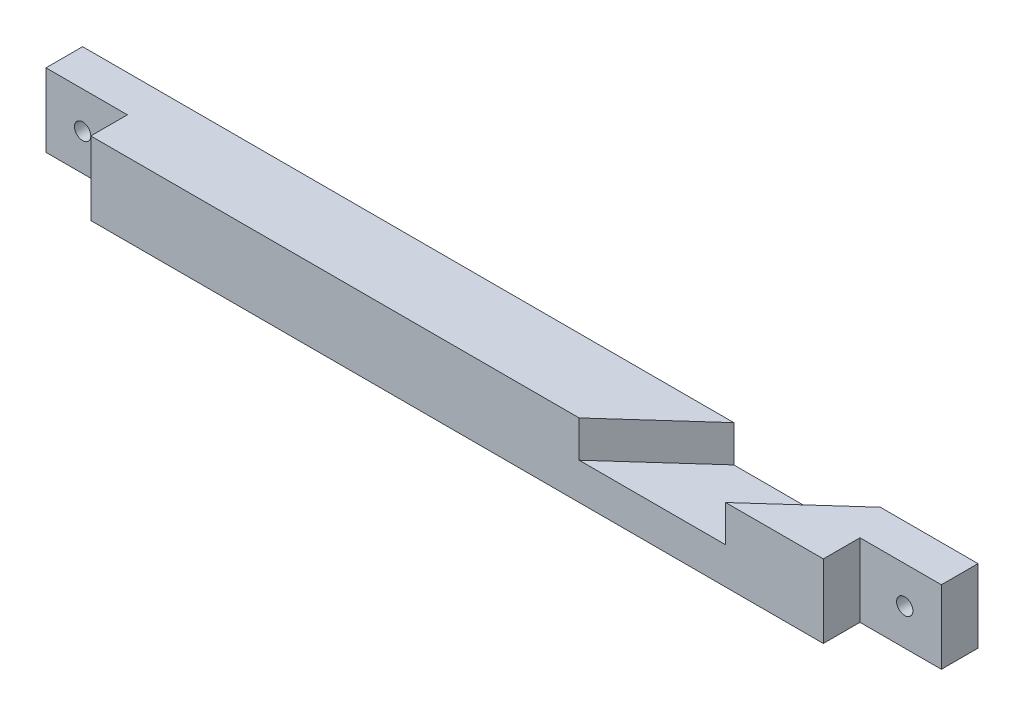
from build123d import *

# Parameters (mm, degrees)
ESQUISSE1_W             = 110
ESQUISSE1_H             = 9
EXTRUSION1_DEPTH        = 9
ESQUISSE2_W             = 10
ESQUISSE2_H             = 9
ENL_V_MAT_EXTRU_1_DEPTH = 4.5
ESQUISSE4_R             = 1
ENL_V_MAT_EXTRU_2_DEPTH = 4.5
ESQUISSE5_R             = 1
ENL_V_MAT_EXTRU_3_DEPTH = 4.5
ENL_V_MAT_EXTRU_4_DEPTH = 4.5
ESQUISSE9_R             = 1
ENL_V_MAT_EXTRU_5_DEPTH = 4.5


with BuildPart() as part:
    # Esquisse1 → Extrusion1 (new body)
    with BuildSketch(Plane.XY):
        with Locations((-12.271684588, -105.117562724)):
            Rectangle(ESQUISSE1_W, ESQUISSE1_H)
    extrude(amount=EXTRUSION1_DEPTH)

    # Esquisse2 → Enl_v. mat.-Extru.1 (cut)
    with BuildSketch(Plane.XY.offset(9)):
        with Locations((-62.271684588, -105.117562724)):
            Rectangle(ESQUISSE2_W, ESQUISSE2_H)
        with Locations((37.728315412, -105.117562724)):
            Rectangle(ESQUISSE2_W, ESQUISSE2_H)
    extrude(amount=-ENL_V_MAT_EXTRU_1_DEPTH, mode=Mode.SUBTRACT)

    # Esquisse4 → Enl_v. mat.-Extru.2 (cut)
    with BuildSketch(Plane.XY.offset(4.5)):
        with Locations((38.22840174, -105.145436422)):
            Circle(ESQUISSE4_R)
    extrude(amount=-ENL_V_MAT_EXTRU_2_DEPTH, mode=Mode.SUBTRACT)

    # Esquisse5 → Enl_v. mat.-Extru.3 (cut)
    with BuildSketch(Plane.XY.offset(4.5)):
        with Locations((-62.771684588, -105.117562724)):
            Circle(ESQUISSE5_R)
    extrude(amount=-ENL_V_MAT_EXTRU_3_DEPTH, mode=Mode.SUBTRACT)

    # Esquisse8 → Enl_v. mat.-Extru.4 (cut)
    with BuildSketch(Plane(origin=(0, -100.617562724, 0), x_dir=(1, 0, 0), z_dir=(0, 1, 0))):
        Polygon((30.728315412, 0), (20.728315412, -9), (2.728315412, -9), (12.728315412, 0), align=None)
    extrude(amount=-ENL_V_MAT_EXTRU_4_DEPTH, mode=Mode.SUBTRACT)

    # Esquisse9 → Enl_v. mat.-Extru.5 (cut)
    with BuildSketch(Plane(origin=(0, -105.117562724, 0), x_dir=(1, 0, 0), z_dir=(0, 1, 0))):
        with Locations(Location((17.728315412, -4.5, 0), (0, 0, 270))):
            Circle(ESQUISSE9_R)
    extrude(amount=-ENL_V_MAT_EXTRU_5_DEPTH, mode=Mode.SUBTRACT)


solid = part.part
